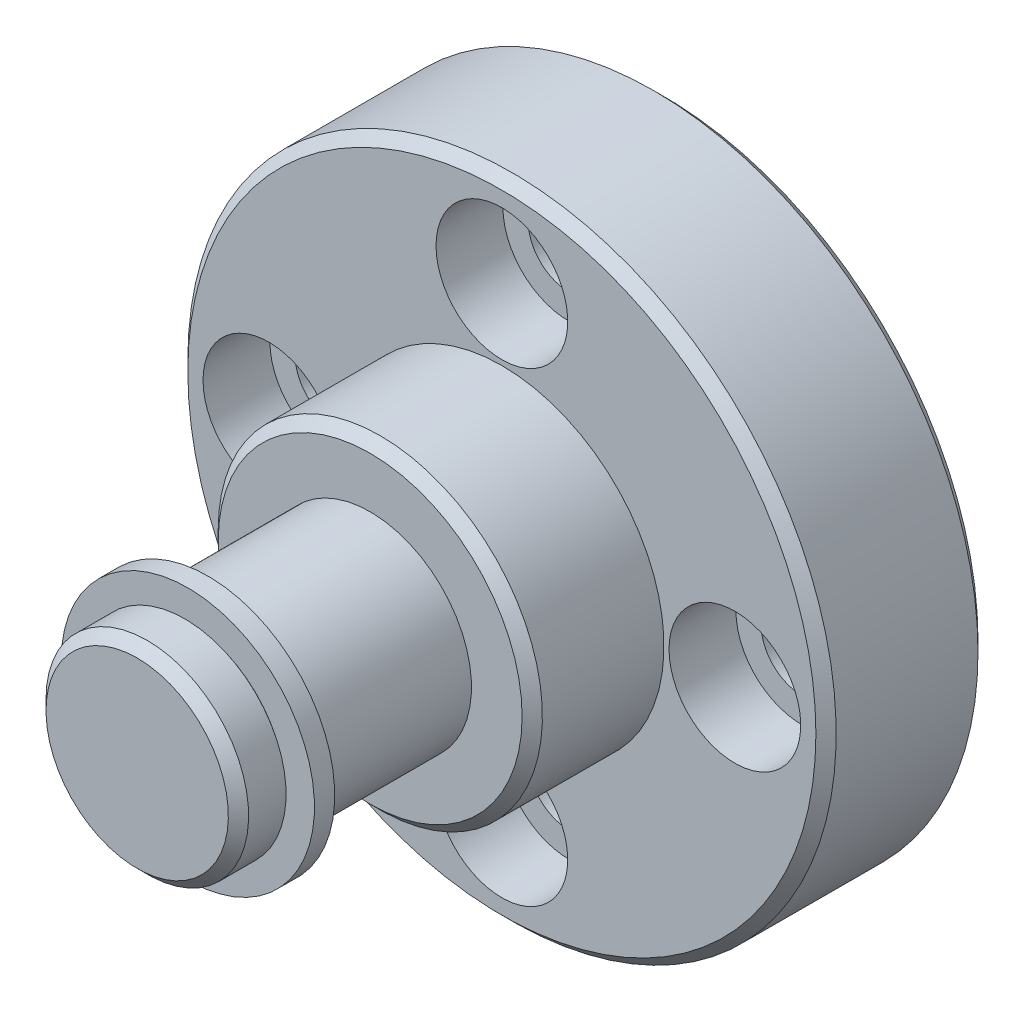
ISO-10303-21;
HEADER;
FILE_DESCRIPTION(('STEP AP214'),'2;1');
FILE_NAME('part.step','',(''),(''),'','','');
FILE_SCHEMA(('AUTOMOTIVE_DESIGN { 1 0 10303 214 1 1 1 1 }'));
ENDSEC;
DATA;
#1=APPLICATION_CONTEXT('core data for automotive mechanical design processes');
#2=APPLICATION_PROTOCOL_DEFINITION('international standard','automotive_design',2000,#1);
#3=PRODUCT_CONTEXT('',#1,'mechanical');
#4=PRODUCT('Part','Part','',(#3));
#5=PRODUCT_RELATED_PRODUCT_CATEGORY('part','',(#4));
#6=PRODUCT_DEFINITION_FORMATION('','',#4);
#7=PRODUCT_DEFINITION_CONTEXT('part definition',#1,'design');
#8=PRODUCT_DEFINITION('design','',#6,#7);
#9=PRODUCT_DEFINITION_SHAPE('','',#8);
#10=(LENGTH_UNIT() NAMED_UNIT(*) SI_UNIT(.MILLI.,.METRE.));
#11=(NAMED_UNIT(*) PLANE_ANGLE_UNIT() SI_UNIT($,.RADIAN.));
#12=(NAMED_UNIT(*) SI_UNIT($,.STERADIAN.) SOLID_ANGLE_UNIT());
#13=UNCERTAINTY_MEASURE_WITH_UNIT(LENGTH_MEASURE(1.E-05),#10,'distance_accuracy_value','');
#14=(GEOMETRIC_REPRESENTATION_CONTEXT(3) GLOBAL_UNCERTAINTY_ASSIGNED_CONTEXT((#13)) GLOBAL_UNIT_ASSIGNED_CONTEXT((#10,
#11,#12)) REPRESENTATION_CONTEXT('',''));
#15=CARTESIAN_POINT('',(0.,0.,0.));
#16=DIRECTION('',(0.,0.,1.));
#17=DIRECTION('',(1.,0.,0.));
#18=AXIS2_PLACEMENT_3D('',#15,#16,#17);
#19=CARTESIAN_POINT('',(6.946,-4.569670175,26.));
#20=DIRECTION('',(0.,0.,1.));
#21=DIRECTION('',(1.,0.,0.));
#22=AXIS2_PLACEMENT_3D('',#19,#20,#21);
#23=PLANE('',#22);
#24=CARTESIAN_POINT('',(11.5,0.,26.));
#25=DIRECTION('',(0.,0.,-1.));
#26=DIRECTION('',(0.,1.,0.));
#27=AXIS2_PLACEMENT_3D('',#24,#25,#26);
#28=CIRCLE('',#27,4.5);
#29=CARTESIAN_POINT('',(11.5,4.5,26.));
#30=VERTEX_POINT('',#29);
#31=EDGE_CURVE('E16',#30,#30,#28,.T.);
#32=ORIENTED_EDGE('',*,*,#31,.F.);
#33=EDGE_LOOP('',(#32));
#34=FACE_BOUND('',#33,.T.);
#35=ADVANCED_FACE('F12',(#34),#23,.T.);
#36=CARTESIAN_POINT('',(11.5,0.,26.));
#37=DIRECTION('',(0.,0.,-1.));
#38=DIRECTION('',(0.,1.,0.));
#39=AXIS2_PLACEMENT_3D('',#36,#37,#38);
#40=CONICAL_SURFACE('',#39,4.5,0.785398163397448);
#41=ORIENTED_EDGE('',*,*,#31,.T.);
#42=EDGE_LOOP('',(#41));
#43=FACE_BOUND('',#42,.T.);
#44=CARTESIAN_POINT('',(11.5,0.,25.5));
#45=DIRECTION('',(0.,0.,-1.));
#46=DIRECTION('',(-1.,0.,0.));
#47=AXIS2_PLACEMENT_3D('',#44,#45,#46);
#48=CIRCLE('',#47,5.);
#49=CARTESIAN_POINT('',(6.5,0.,25.5));
#50=VERTEX_POINT('',#49);
#51=EDGE_CURVE('E28',#50,#50,#48,.T.);
#52=ORIENTED_EDGE('',*,*,#51,.F.);
#53=EDGE_LOOP('',(#52));
#54=FACE_BOUND('',#53,.T.);
#55=ADVANCED_FACE('F114',(#43,#54),#40,.T.);
#56=CARTESIAN_POINT('',(11.5,0.,25.5));
#57=DIRECTION('',(0.,0.,-1.));
#58=DIRECTION('',(-1.,0.,0.));
#59=AXIS2_PLACEMENT_3D('',#56,#57,#58);
#60=CYLINDRICAL_SURFACE('',#59,5.);
#61=ORIENTED_EDGE('',*,*,#51,.T.);
#62=EDGE_LOOP('',(#61));
#63=FACE_BOUND('',#62,.T.);
#64=CARTESIAN_POINT('',(11.5,0.,23.65));
#65=DIRECTION('',(0.,0.,-1.));
#66=DIRECTION('',(-1.,0.,0.));
#67=AXIS2_PLACEMENT_3D('',#64,#65,#66);
#68=CIRCLE('',#67,5.);
#69=CARTESIAN_POINT('',(6.5,0.,23.65));
#70=VERTEX_POINT('',#69);
#71=EDGE_CURVE('E104',#70,#70,#68,.T.);
#72=ORIENTED_EDGE('',*,*,#71,.F.);
#73=EDGE_LOOP('',(#72));
#74=FACE_BOUND('',#73,.T.);
#75=ADVANCED_FACE('F124',(#63,#74),#60,.T.);
#76=CARTESIAN_POINT('',(16.56,-5.077411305,23.65));
#77=DIRECTION('',(0.,0.,-1.));
#78=DIRECTION('',(-1.,0.,0.));
#79=AXIS2_PLACEMENT_3D('',#76,#77,#78);
#80=PLANE('',#79);
#81=CARTESIAN_POINT('',(11.5,0.,23.65));
#82=DIRECTION('',(0.,0.,-1.));
#83=DIRECTION('',(-1.,0.,0.));
#84=AXIS2_PLACEMENT_3D('',#81,#82,#83);
#85=CIRCLE('',#84,4.8);
#86=CARTESIAN_POINT('',(6.7,0.,23.65));
#87=VERTEX_POINT('',#86);
#88=EDGE_CURVE('E102',#87,#87,#85,.T.);
#89=ORIENTED_EDGE('',*,*,#88,.F.);
#90=EDGE_LOOP('',(#89));
#91=FACE_BOUND('',#90,.T.);
#92=ORIENTED_EDGE('',*,*,#71,.T.);
#93=EDGE_LOOP('',(#92));
#94=FACE_BOUND('',#93,.T.);
#95=ADVANCED_FACE('F205',(#91,#94),#80,.T.);
#96=CARTESIAN_POINT('',(11.5,0.,23.65));
#97=DIRECTION('',(0.,0.,-1.));
#98=DIRECTION('',(-1.,0.,0.));
#99=AXIS2_PLACEMENT_3D('',#96,#97,#98);
#100=CYLINDRICAL_SURFACE('',#99,4.8);
#101=ORIENTED_EDGE('',*,*,#88,.T.);
#102=EDGE_LOOP('',(#101));
#103=FACE_BOUND('',#102,.T.);
#104=CARTESIAN_POINT('',(11.5,0.,23.5));
#105=DIRECTION('',(0.,0.,-1.));
#106=DIRECTION('',(-1.,0.,0.));
#107=AXIS2_PLACEMENT_3D('',#104,#105,#106);
#108=CIRCLE('',#107,4.8);
#109=CARTESIAN_POINT('',(6.7,0.,23.5));
#110=VERTEX_POINT('',#109);
#111=EDGE_CURVE('E99',#110,#110,#108,.T.);
#112=ORIENTED_EDGE('',*,*,#111,.F.);
#113=EDGE_LOOP('',(#112));
#114=FACE_BOUND('',#113,.T.);
#115=ADVANCED_FACE('F202',(#103,#114),#100,.T.);
#116=CARTESIAN_POINT('',(5.175,-6.346764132,23.5));
#117=DIRECTION('',(0.,0.,1.));
#118=DIRECTION('',(1.,0.,0.));
#119=AXIS2_PLACEMENT_3D('',#116,#117,#118);
#120=PLANE('',#119);
#121=ORIENTED_EDGE('',*,*,#111,.T.);
#122=EDGE_LOOP('',(#121));
#123=FACE_BOUND('',#122,.T.);
#124=CARTESIAN_POINT('',(11.5,0.,23.5));
#125=DIRECTION('',(0.,0.,-1.));
#126=DIRECTION('',(-1.,0.,0.));
#127=AXIS2_PLACEMENT_3D('',#124,#125,#126);
#128=CIRCLE('',#127,6.25);
#129=CARTESIAN_POINT('',(5.25,0.,23.5));
#130=VERTEX_POINT('',#129);
#131=EDGE_CURVE('E96',#130,#130,#128,.T.);
#132=ORIENTED_EDGE('',*,*,#131,.F.);
#133=EDGE_LOOP('',(#132));
#134=FACE_BOUND('',#133,.T.);
#135=ADVANCED_FACE('F200',(#123,#134),#120,.T.);
#136=CARTESIAN_POINT('',(11.5,0.,23.5));
#137=DIRECTION('',(0.,0.,-1.));
#138=DIRECTION('',(-1.,0.,0.));
#139=AXIS2_PLACEMENT_3D('',#136,#137,#138);
#140=CYLINDRICAL_SURFACE('',#139,6.25);
#141=ORIENTED_EDGE('',*,*,#131,.T.);
#142=EDGE_LOOP('',(#141));
#143=FACE_BOUND('',#142,.T.);
#144=CARTESIAN_POINT('',(11.5,0.,22.5));
#145=DIRECTION('',(0.,0.,-1.));
#146=DIRECTION('',(-1.,0.,0.));
#147=AXIS2_PLACEMENT_3D('',#144,#145,#146);
#148=CIRCLE('',#147,6.25);
#149=CARTESIAN_POINT('',(5.25,0.,22.5));
#150=VERTEX_POINT('',#149);
#151=EDGE_CURVE('E93',#150,#150,#148,.T.);
#152=ORIENTED_EDGE('',*,*,#151,.F.);
#153=EDGE_LOOP('',(#152));
#154=FACE_BOUND('',#153,.T.);
#155=ADVANCED_FACE('F197',(#143,#154),#140,.T.);
#156=CARTESIAN_POINT('',(17.825,-6.346764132,22.5));
#157=DIRECTION('',(0.,0.,-1.));
#158=DIRECTION('',(-1.,0.,0.));
#159=AXIS2_PLACEMENT_3D('',#156,#157,#158);
#160=PLANE('',#159);
#161=CARTESIAN_POINT('',(11.5,0.,22.5));
#162=DIRECTION('',(0.,0.,-1.));
#163=DIRECTION('',(-1.,0.,0.));
#164=AXIS2_PLACEMENT_3D('',#161,#162,#163);
#165=CIRCLE('',#164,5.);
#166=CARTESIAN_POINT('',(6.5,0.,22.5));
#167=VERTEX_POINT('',#166);
#168=EDGE_CURVE('E90',#167,#167,#165,.T.);
#169=ORIENTED_EDGE('',*,*,#168,.F.);
#170=EDGE_LOOP('',(#169));
#171=FACE_BOUND('',#170,.T.);
#172=ORIENTED_EDGE('',*,*,#151,.T.);
#173=EDGE_LOOP('',(#172));
#174=FACE_BOUND('',#173,.T.);
#175=ADVANCED_FACE('F195',(#171,#174),#160,.T.);
#176=CARTESIAN_POINT('',(11.5,0.,22.5));
#177=DIRECTION('',(0.,0.,-1.));
#178=DIRECTION('',(-1.,0.,0.));
#179=AXIS2_PLACEMENT_3D('',#176,#177,#178);
#180=CYLINDRICAL_SURFACE('',#179,5.);
#181=ORIENTED_EDGE('',*,*,#168,.T.);
#182=EDGE_LOOP('',(#181));
#183=FACE_BOUND('',#182,.T.);
#184=CARTESIAN_POINT('',(11.5,0.,14.5));
#185=DIRECTION('',(0.,0.,-1.));
#186=DIRECTION('',(-1.,0.,0.));
#187=AXIS2_PLACEMENT_3D('',#184,#185,#186);
#188=CIRCLE('',#187,5.);
#189=CARTESIAN_POINT('',(6.5,0.,14.5));
#190=VERTEX_POINT('',#189);
#191=EDGE_CURVE('E87',#190,#190,#188,.T.);
#192=ORIENTED_EDGE('',*,*,#191,.F.);
#193=EDGE_LOOP('',(#192));
#194=FACE_BOUND('',#193,.T.);
#195=ADVANCED_FACE('F191',(#183,#194),#180,.T.);
#196=CARTESIAN_POINT('',(11.5,0.,0.));
#197=DIRECTION('',(0.,0.,1.));
#198=DIRECTION('',(1.,0.,0.));
#199=AXIS2_PLACEMENT_3D('',#196,#197,#198);
#200=CONICAL_SURFACE('',#199,15.5,0.785398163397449);
#201=CARTESIAN_POINT('',(11.5,0.,0.));
#202=DIRECTION('',(0.,0.,1.));
#203=DIRECTION('',(1.,0.,0.));
#204=AXIS2_PLACEMENT_3D('',#201,#202,#203);
#205=CIRCLE('',#204,15.5);
#206=CARTESIAN_POINT('',(27.,0.,0.));
#207=VERTEX_POINT('',#206);
#208=EDGE_CURVE('E84',#207,#207,#205,.F.);
#209=ORIENTED_EDGE('',*,*,#208,.F.);
#210=EDGE_LOOP('',(#209));
#211=FACE_BOUND('',#210,.T.);
#212=CARTESIAN_POINT('',(11.5,0.,0.5));
#213=DIRECTION('',(0.,0.,-1.));
#214=DIRECTION('',(-1.,0.,0.));
#215=AXIS2_PLACEMENT_3D('',#212,#213,#214);
#216=CIRCLE('',#215,16.);
#217=CARTESIAN_POINT('',(-4.5,0.,0.5));
#218=VERTEX_POINT('',#217);
#219=EDGE_CURVE('E74',#218,#218,#216,.F.);
#220=ORIENTED_EDGE('',*,*,#219,.F.);
#221=EDGE_LOOP('',(#220));
#222=FACE_BOUND('',#221,.T.);
#223=ADVANCED_FACE('F187',(#211,#222),#200,.T.);
#224=CARTESIAN_POINT('',(11.5,-11.5,4.7));
#225=DIRECTION('',(0.,0.,-1.));
#226=DIRECTION('',(-1.,0.,0.));
#227=AXIS2_PLACEMENT_3D('',#224,#225,#226);
#228=CYLINDRICAL_SURFACE('',#227,2.);
#229=CARTESIAN_POINT('',(11.5,-11.5,4.7));
#230=DIRECTION('',(0.,0.,-1.));
#231=DIRECTION('',(-1.,0.,0.));
#232=AXIS2_PLACEMENT_3D('',#229,#230,#231);
#233=CIRCLE('',#232,2.);
#234=CARTESIAN_POINT('',(9.5,-11.5,4.7));
#235=VERTEX_POINT('',#234);
#236=EDGE_CURVE('E71',#235,#235,#233,.F.);
#237=ORIENTED_EDGE('',*,*,#236,.T.);
#238=EDGE_LOOP('',(#237));
#239=FACE_BOUND('',#238,.T.);
#240=CARTESIAN_POINT('',(11.5,-11.5,0.));
#241=DIRECTION('',(0.,0.,-1.));
#242=DIRECTION('',(-1.,0.,0.));
#243=AXIS2_PLACEMENT_3D('',#240,#241,#242);
#244=CIRCLE('',#243,2.);
#245=CARTESIAN_POINT('',(9.5,-11.5,0.));
#246=VERTEX_POINT('',#245);
#247=EDGE_CURVE('E81',#246,#246,#244,.F.);
#248=ORIENTED_EDGE('',*,*,#247,.F.);
#249=EDGE_LOOP('',(#248));
#250=FACE_BOUND('',#249,.T.);
#251=ADVANCED_FACE('F183',(#239,#250),#228,.F.);
#252=CARTESIAN_POINT('',(23.,0.,4.7));
#253=DIRECTION('',(0.,0.,-1.));
#254=DIRECTION('',(-1.,0.,0.));
#255=AXIS2_PLACEMENT_3D('',#252,#253,#254);
#256=CYLINDRICAL_SURFACE('',#255,2.);
#257=CARTESIAN_POINT('',(23.,0.,4.7));
#258=DIRECTION('',(0.,0.,-1.));
#259=DIRECTION('',(-1.,0.,0.));
#260=AXIS2_PLACEMENT_3D('',#257,#258,#259);
#261=CIRCLE('',#260,2.);
#262=CARTESIAN_POINT('',(21.,0.,4.7));
#263=VERTEX_POINT('',#262);
#264=EDGE_CURVE('E68',#263,#263,#261,.F.);
#265=ORIENTED_EDGE('',*,*,#264,.T.);
#266=EDGE_LOOP('',(#265));
#267=FACE_BOUND('',#266,.T.);
#268=CARTESIAN_POINT('',(23.,0.,0.));
#269=DIRECTION('',(0.,0.,-1.));
#270=DIRECTION('',(-1.,0.,0.));
#271=AXIS2_PLACEMENT_3D('',#268,#269,#270);
#272=CIRCLE('',#271,2.);
#273=CARTESIAN_POINT('',(21.,0.,0.));
#274=VERTEX_POINT('',#273);
#275=EDGE_CURVE('E78',#274,#274,#272,.F.);
#276=ORIENTED_EDGE('',*,*,#275,.F.);
#277=EDGE_LOOP('',(#276));
#278=FACE_BOUND('',#277,.T.);
#279=ADVANCED_FACE('F179',(#267,#278),#256,.F.);
#280=CARTESIAN_POINT('',(11.5,11.5,4.7));
#281=DIRECTION('',(0.,0.,-1.));
#282=DIRECTION('',(-1.,0.,0.));
#283=AXIS2_PLACEMENT_3D('',#280,#281,#282);
#284=CYLINDRICAL_SURFACE('',#283,2.);
#285=CARTESIAN_POINT('',(11.5,11.5,4.7));
#286=DIRECTION('',(0.,0.,-1.));
#287=DIRECTION('',(-1.,0.,0.));
#288=AXIS2_PLACEMENT_3D('',#285,#286,#287);
#289=CIRCLE('',#288,2.);
#290=CARTESIAN_POINT('',(9.5,11.5,4.7));
#291=VERTEX_POINT('',#290);
#292=EDGE_CURVE('E65',#291,#291,#289,.F.);
#293=ORIENTED_EDGE('',*,*,#292,.T.);
#294=EDGE_LOOP('',(#293));
#295=FACE_BOUND('',#294,.T.);
#296=CARTESIAN_POINT('',(11.5,11.5,0.));
#297=DIRECTION('',(0.,0.,-1.));
#298=DIRECTION('',(-1.,0.,0.));
#299=AXIS2_PLACEMENT_3D('',#296,#297,#298);
#300=CIRCLE('',#299,2.);
#301=CARTESIAN_POINT('',(9.5,11.5,0.));
#302=VERTEX_POINT('',#301);
#303=EDGE_CURVE('E75',#302,#302,#300,.F.);
#304=ORIENTED_EDGE('',*,*,#303,.F.);
#305=EDGE_LOOP('',(#304));
#306=FACE_BOUND('',#305,.T.);
#307=ADVANCED_FACE('F175',(#295,#306),#284,.F.);
#308=CARTESIAN_POINT('',(3.91,-7.616116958,14.5));
#309=DIRECTION('',(0.,0.,1.));
#310=DIRECTION('',(1.,0.,0.));
#311=AXIS2_PLACEMENT_3D('',#308,#309,#310);
#312=PLANE('',#311);
#313=ORIENTED_EDGE('',*,*,#191,.T.);
#314=EDGE_LOOP('',(#313));
#315=FACE_BOUND('',#314,.T.);
#316=CARTESIAN_POINT('',(11.5,0.,14.5));
#317=DIRECTION('',(0.,0.,-1.));
#318=DIRECTION('',(-1.,0.,0.));
#319=AXIS2_PLACEMENT_3D('',#316,#317,#318);
#320=CIRCLE('',#319,7.5);
#321=CARTESIAN_POINT('',(4.,0.,14.5));
#322=VERTEX_POINT('',#321);
#323=EDGE_CURVE('E62',#322,#322,#320,.T.);
#324=ORIENTED_EDGE('',*,*,#323,.F.);
#325=EDGE_LOOP('',(#324));
#326=FACE_BOUND('',#325,.T.);
#327=ADVANCED_FACE('F178',(#315,#326),#312,.T.);
#328=CARTESIAN_POINT('',(27.186,-15.739975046,0.));
#329=DIRECTION('',(0.,0.,-1.));
#330=DIRECTION('',(-1.,0.,0.));
#331=AXIS2_PLACEMENT_3D('',#328,#329,#330);
#332=PLANE('',#331);
#333=ORIENTED_EDGE('',*,*,#303,.T.);
#334=EDGE_LOOP('',(#333));
#335=FACE_BOUND('',#334,.T.);
#336=ORIENTED_EDGE('',*,*,#275,.T.);
#337=EDGE_LOOP('',(#336));
#338=FACE_BOUND('',#337,.T.);
#339=ORIENTED_EDGE('',*,*,#247,.T.);
#340=EDGE_LOOP('',(#339));
#341=FACE_BOUND('',#340,.T.);
#342=CARTESIAN_POINT('',(0.,0.,0.));
#343=DIRECTION('',(0.,0.,-1.));
#344=DIRECTION('',(-1.,0.,0.));
#345=AXIS2_PLACEMENT_3D('',#342,#343,#344);
#346=CIRCLE('',#345,2.);
#347=CARTESIAN_POINT('',(-2.,0.,0.));
#348=VERTEX_POINT('',#347);
#349=EDGE_CURVE('E59',#348,#348,#346,.F.);
#350=ORIENTED_EDGE('',*,*,#349,.T.);
#351=EDGE_LOOP('',(#350));
#352=FACE_BOUND('',#351,.T.);
#353=ORIENTED_EDGE('',*,*,#208,.T.);
#354=EDGE_LOOP('',(#353));
#355=FACE_BOUND('',#354,.T.);
#356=ADVANCED_FACE('F173',(#335,#338,#341,#352,#355),#332,.T.);
#357=CARTESIAN_POINT('',(11.5,0.,7.5));
#358=DIRECTION('',(0.,0.,-1.));
#359=DIRECTION('',(0.,1.,0.));
#360=AXIS2_PLACEMENT_3D('',#357,#358,#359);
#361=CYLINDRICAL_SURFACE('',#360,16.);
#362=CARTESIAN_POINT('',(11.5,0.,7.5));
#363=DIRECTION('',(0.,0.,-1.));
#364=DIRECTION('',(-1.,0.,0.));
#365=AXIS2_PLACEMENT_3D('',#362,#363,#364);
#366=CIRCLE('',#365,16.);
#367=CARTESIAN_POINT('',(-4.5,0.,7.49999999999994));
#368=VERTEX_POINT('',#367);
#369=EDGE_CURVE('E58',#368,#368,#366,.F.);
#370=ORIENTED_EDGE('',*,*,#369,.F.);
#371=EDGE_LOOP('',(#370));
#372=FACE_BOUND('',#371,.T.);
#373=ORIENTED_EDGE('',*,*,#219,.T.);
#374=EDGE_LOOP('',(#373));
#375=FACE_BOUND('',#374,.T.);
#376=ADVANCED_FACE('F169',(#372,#375),#361,.T.);
#377=CARTESIAN_POINT('',(8.211,-8.199682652,4.7));
#378=DIRECTION('',(0.,0.,-1.));
#379=DIRECTION('',(1.,0.,0.));
#380=AXIS2_PLACEMENT_3D('',#377,#378,#379);
#381=PLANE('',#380);
#382=ORIENTED_EDGE('',*,*,#236,.F.);
#383=EDGE_LOOP('',(#382));
#384=FACE_BOUND('',#383,.T.);
#385=CARTESIAN_POINT('',(11.5,-11.5,4.7));
#386=DIRECTION('',(0.,0.,-1.));
#387=DIRECTION('',(-1.,0.,0.));
#388=AXIS2_PLACEMENT_3D('',#385,#386,#387);
#389=CIRCLE('',#388,3.25);
#390=CARTESIAN_POINT('',(8.25,-11.5,4.7));
#391=VERTEX_POINT('',#390);
#392=EDGE_CURVE('E55',#391,#391,#389,.F.);
#393=ORIENTED_EDGE('',*,*,#392,.T.);
#394=EDGE_LOOP('',(#393));
#395=FACE_BOUND('',#394,.T.);
#396=ADVANCED_FACE('F172',(#384,#395),#381,.F.);
#397=CARTESIAN_POINT('',(19.699682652,-3.289,4.7));
#398=DIRECTION('',(0.,0.,-1.));
#399=DIRECTION('',(0.,1.,0.));
#400=AXIS2_PLACEMENT_3D('',#397,#398,#399);
#401=PLANE('',#400);
#402=ORIENTED_EDGE('',*,*,#264,.F.);
#403=EDGE_LOOP('',(#402));
#404=FACE_BOUND('',#403,.T.);
#405=CARTESIAN_POINT('',(23.,0.,4.7));
#406=DIRECTION('',(0.,0.,-1.));
#407=DIRECTION('',(-1.,0.,0.));
#408=AXIS2_PLACEMENT_3D('',#405,#406,#407);
#409=CIRCLE('',#408,3.25);
#410=CARTESIAN_POINT('',(19.75,0.,4.7));
#411=VERTEX_POINT('',#410);
#412=EDGE_CURVE('E52',#411,#411,#409,.F.);
#413=ORIENTED_EDGE('',*,*,#412,.T.);
#414=EDGE_LOOP('',(#413));
#415=FACE_BOUND('',#414,.T.);
#416=ADVANCED_FACE('F233',(#404,#415),#401,.F.);
#417=CARTESIAN_POINT('',(14.789,8.199682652,4.7));
#418=DIRECTION('',(0.,0.,-1.));
#419=DIRECTION('',(-1.,0.,0.));
#420=AXIS2_PLACEMENT_3D('',#417,#418,#419);
#421=PLANE('',#420);
#422=ORIENTED_EDGE('',*,*,#292,.F.);
#423=EDGE_LOOP('',(#422));
#424=FACE_BOUND('',#423,.T.);
#425=CARTESIAN_POINT('',(11.5,11.5,4.7));
#426=DIRECTION('',(0.,0.,-1.));
#427=DIRECTION('',(-1.,0.,0.));
#428=AXIS2_PLACEMENT_3D('',#425,#426,#427);
#429=CIRCLE('',#428,3.25);
#430=CARTESIAN_POINT('',(8.25,11.5,4.7));
#431=VERTEX_POINT('',#430);
#432=EDGE_CURVE('E49',#431,#431,#429,.F.);
#433=ORIENTED_EDGE('',*,*,#432,.T.);
#434=EDGE_LOOP('',(#433));
#435=FACE_BOUND('',#434,.T.);
#436=ADVANCED_FACE('F167',(#424,#435),#421,.F.);
#437=CARTESIAN_POINT('',(11.5,0.,14.5));
#438=DIRECTION('',(0.,0.,-1.));
#439=DIRECTION('',(-1.,0.,0.));
#440=AXIS2_PLACEMENT_3D('',#437,#438,#439);
#441=CONICAL_SURFACE('',#440,7.5,0.785398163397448);
#442=ORIENTED_EDGE('',*,*,#323,.T.);
#443=EDGE_LOOP('',(#442));
#444=FACE_BOUND('',#443,.T.);
#445=CARTESIAN_POINT('',(11.5,0.,14.));
#446=DIRECTION('',(0.,0.,-1.));
#447=DIRECTION('',(-1.,0.,0.));
#448=AXIS2_PLACEMENT_3D('',#445,#446,#447);
#449=CIRCLE('',#448,8.);
#450=CARTESIAN_POINT('',(3.5,0.,14.));
#451=VERTEX_POINT('',#450);
#452=EDGE_CURVE('E48',#451,#451,#449,.T.);
#453=ORIENTED_EDGE('',*,*,#452,.F.);
#454=EDGE_LOOP('',(#453));
#455=FACE_BOUND('',#454,.T.);
#456=ADVANCED_FACE('F163',(#444,#455),#441,.T.);
#457=CARTESIAN_POINT('',(0.,0.,4.7));
#458=DIRECTION('',(0.,0.,-1.));
#459=DIRECTION('',(-1.,0.,0.));
#460=AXIS2_PLACEMENT_3D('',#457,#458,#459);
#461=CYLINDRICAL_SURFACE('',#460,2.);
#462=CARTESIAN_POINT('',(0.,0.,4.7));
#463=DIRECTION('',(0.,0.,-1.));
#464=DIRECTION('',(-1.,0.,0.));
#465=AXIS2_PLACEMENT_3D('',#462,#463,#464);
#466=CIRCLE('',#465,2.);
#467=CARTESIAN_POINT('',(-2.,0.,4.7));
#468=VERTEX_POINT('',#467);
#469=EDGE_CURVE('E45',#468,#468,#466,.F.);
#470=ORIENTED_EDGE('',*,*,#469,.T.);
#471=EDGE_LOOP('',(#470));
#472=FACE_BOUND('',#471,.T.);
#473=ORIENTED_EDGE('',*,*,#349,.F.);
#474=EDGE_LOOP('',(#473));
#475=FACE_BOUND('',#474,.T.);
#476=ADVANCED_FACE('F159',(#472,#475),#461,.F.);
#477=CARTESIAN_POINT('',(11.5,0.,8.));
#478=DIRECTION('',(0.,0.,-1.));
#479=DIRECTION('',(-1.,0.,0.));
#480=AXIS2_PLACEMENT_3D('',#477,#478,#479);
#481=CONICAL_SURFACE('',#480,15.5,0.785398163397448);
#482=CARTESIAN_POINT('',(11.5,0.,8.));
#483=DIRECTION('',(0.,0.,-1.));
#484=DIRECTION('',(-1.,0.,0.));
#485=AXIS2_PLACEMENT_3D('',#482,#483,#484);
#486=CIRCLE('',#485,15.5);
#487=CARTESIAN_POINT('',(-4.,0.,8.));
#488=VERTEX_POINT('',#487);
#489=EDGE_CURVE('E42',#488,#488,#486,.F.);
#490=ORIENTED_EDGE('',*,*,#489,.F.);
#491=EDGE_LOOP('',(#490));
#492=FACE_BOUND('',#491,.T.);
#493=ORIENTED_EDGE('',*,*,#369,.T.);
#494=EDGE_LOOP('',(#493));
#495=FACE_BOUND('',#494,.T.);
#496=ADVANCED_FACE('F155',(#492,#495),#481,.T.);
#497=CARTESIAN_POINT('',(11.5,-11.5,8.));
#498=DIRECTION('',(0.,0.,-1.));
#499=DIRECTION('',(-1.,0.,0.));
#500=AXIS2_PLACEMENT_3D('',#497,#498,#499);
#501=CYLINDRICAL_SURFACE('',#500,3.25);
#502=ORIENTED_EDGE('',*,*,#392,.F.);
#503=EDGE_LOOP('',(#502));
#504=FACE_BOUND('',#503,.T.);
#505=CARTESIAN_POINT('',(11.5,-11.5,8.));
#506=DIRECTION('',(0.,0.,-1.));
#507=DIRECTION('',(-1.,0.,0.));
#508=AXIS2_PLACEMENT_3D('',#505,#506,#507);
#509=CIRCLE('',#508,3.25);
#510=CARTESIAN_POINT('',(8.25,-11.5,8.));
#511=VERTEX_POINT('',#510);
#512=EDGE_CURVE('E39',#511,#511,#509,.T.);
#513=ORIENTED_EDGE('',*,*,#512,.F.);
#514=EDGE_LOOP('',(#513));
#515=FACE_BOUND('',#514,.T.);
#516=ADVANCED_FACE('F151',(#504,#515),#501,.F.);
#517=CARTESIAN_POINT('',(23.,0.,8.));
#518=DIRECTION('',(0.,0.,-1.));
#519=DIRECTION('',(-1.,0.,0.));
#520=AXIS2_PLACEMENT_3D('',#517,#518,#519);
#521=CYLINDRICAL_SURFACE('',#520,3.25);
#522=ORIENTED_EDGE('',*,*,#412,.F.);
#523=EDGE_LOOP('',(#522));
#524=FACE_BOUND('',#523,.T.);
#525=CARTESIAN_POINT('',(23.,0.,8.));
#526=DIRECTION('',(0.,0.,-1.));
#527=DIRECTION('',(-1.,0.,0.));
#528=AXIS2_PLACEMENT_3D('',#525,#526,#527);
#529=CIRCLE('',#528,3.25);
#530=CARTESIAN_POINT('',(19.75,0.,8.));
#531=VERTEX_POINT('',#530);
#532=EDGE_CURVE('E36',#531,#531,#529,.T.);
#533=ORIENTED_EDGE('',*,*,#532,.F.);
#534=EDGE_LOOP('',(#533));
#535=FACE_BOUND('',#534,.T.);
#536=ADVANCED_FACE('F147',(#524,#535),#521,.F.);
#537=CARTESIAN_POINT('',(11.5,11.5,8.));
#538=DIRECTION('',(0.,0.,-1.));
#539=DIRECTION('',(-1.,0.,0.));
#540=AXIS2_PLACEMENT_3D('',#537,#538,#539);
#541=CYLINDRICAL_SURFACE('',#540,3.25);
#542=ORIENTED_EDGE('',*,*,#432,.F.);
#543=EDGE_LOOP('',(#542));
#544=FACE_BOUND('',#543,.T.);
#545=CARTESIAN_POINT('',(11.5,11.5,8.));
#546=DIRECTION('',(0.,0.,-1.));
#547=DIRECTION('',(-1.,0.,0.));
#548=AXIS2_PLACEMENT_3D('',#545,#546,#547);
#549=CIRCLE('',#548,3.25);
#550=CARTESIAN_POINT('',(8.25,11.5,8.));
#551=VERTEX_POINT('',#550);
#552=EDGE_CURVE('E33',#551,#551,#549,.T.);
#553=ORIENTED_EDGE('',*,*,#552,.F.);
#554=EDGE_LOOP('',(#553));
#555=FACE_BOUND('',#554,.T.);
#556=ADVANCED_FACE('F143',(#544,#555),#541,.F.);
#557=CARTESIAN_POINT('',(11.5,0.,14.));
#558=DIRECTION('',(0.,0.,-1.));
#559=DIRECTION('',(0.,1.,0.));
#560=AXIS2_PLACEMENT_3D('',#557,#558,#559);
#561=CYLINDRICAL_SURFACE('',#560,8.);
#562=ORIENTED_EDGE('',*,*,#452,.T.);
#563=EDGE_LOOP('',(#562));
#564=FACE_BOUND('',#563,.T.);
#565=CARTESIAN_POINT('',(11.5,0.,8.));
#566=DIRECTION('',(0.,0.,-1.));
#567=DIRECTION('',(0.,1.,0.));
#568=AXIS2_PLACEMENT_3D('',#565,#566,#567);
#569=CIRCLE('',#568,8.);
#570=CARTESIAN_POINT('',(11.5,8.,8.));
#571=VERTEX_POINT('',#570);
#572=EDGE_CURVE('E25',#571,#571,#569,.T.);
#573=ORIENTED_EDGE('',*,*,#572,.F.);
#574=EDGE_LOOP('',(#573));
#575=FACE_BOUND('',#574,.T.);
#576=ADVANCED_FACE('F140',(#564,#575),#561,.T.);
#577=CARTESIAN_POINT('',(3.300317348,3.289,4.7));
#578=DIRECTION('',(0.,0.,-1.));
#579=DIRECTION('',(0.,-1.,0.));
#580=AXIS2_PLACEMENT_3D('',#577,#578,#579);
#581=PLANE('',#580);
#582=ORIENTED_EDGE('',*,*,#469,.F.);
#583=EDGE_LOOP('',(#582));
#584=FACE_BOUND('',#583,.T.);
#585=CARTESIAN_POINT('',(0.,0.,4.7));
#586=DIRECTION('',(0.,0.,-1.));
#587=DIRECTION('',(-1.,0.,0.));
#588=AXIS2_PLACEMENT_3D('',#585,#586,#587);
#589=CIRCLE('',#588,3.25);
#590=CARTESIAN_POINT('',(-3.25,0.,4.7));
#591=VERTEX_POINT('',#590);
#592=EDGE_CURVE('E20',#591,#591,#589,.F.);
#593=ORIENTED_EDGE('',*,*,#592,.T.);
#594=EDGE_LOOP('',(#593));
#595=FACE_BOUND('',#594,.T.);
#596=ADVANCED_FACE('F135',(#584,#595),#581,.F.);
#597=CARTESIAN_POINT('',(-4.186,-15.739975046,8.));
#598=DIRECTION('',(0.,0.,1.));
#599=DIRECTION('',(1.,0.,0.));
#600=AXIS2_PLACEMENT_3D('',#597,#598,#599);
#601=PLANE('',#600);
#602=ORIENTED_EDGE('',*,*,#572,.T.);
#603=EDGE_LOOP('',(#602));
#604=FACE_BOUND('',#603,.T.);
#605=ORIENTED_EDGE('',*,*,#552,.T.);
#606=EDGE_LOOP('',(#605));
#607=FACE_BOUND('',#606,.T.);
#608=ORIENTED_EDGE('',*,*,#532,.T.);
#609=EDGE_LOOP('',(#608));
#610=FACE_BOUND('',#609,.T.);
#611=ORIENTED_EDGE('',*,*,#512,.T.);
#612=EDGE_LOOP('',(#611));
#613=FACE_BOUND('',#612,.T.);
#614=CARTESIAN_POINT('',(0.,0.,8.));
#615=DIRECTION('',(0.,0.,-1.));
#616=DIRECTION('',(-1.,0.,0.));
#617=AXIS2_PLACEMENT_3D('',#614,#615,#616);
#618=CIRCLE('',#617,3.25);
#619=CARTESIAN_POINT('',(-3.25,0.,8.));
#620=VERTEX_POINT('',#619);
#621=EDGE_CURVE('E8',#620,#620,#618,.T.);
#622=ORIENTED_EDGE('',*,*,#621,.T.);
#623=EDGE_LOOP('',(#622));
#624=FACE_BOUND('',#623,.T.);
#625=ORIENTED_EDGE('',*,*,#489,.T.);
#626=EDGE_LOOP('',(#625));
#627=FACE_BOUND('',#626,.T.);
#628=ADVANCED_FACE('F14',(#604,#607,#610,#613,#624,#627),#601,.T.);
#629=CARTESIAN_POINT('',(0.,0.,8.));
#630=DIRECTION('',(0.,0.,-1.));
#631=DIRECTION('',(-1.,0.,0.));
#632=AXIS2_PLACEMENT_3D('',#629,#630,#631);
#633=CYLINDRICAL_SURFACE('',#632,3.25);
#634=ORIENTED_EDGE('',*,*,#592,.F.);
#635=EDGE_LOOP('',(#634));
#636=FACE_BOUND('',#635,.T.);
#637=ORIENTED_EDGE('',*,*,#621,.F.);
#638=EDGE_LOOP('',(#637));
#639=FACE_BOUND('',#638,.T.);
#640=ADVANCED_FACE('F128',(#636,#639),#633,.F.);
#641=CLOSED_SHELL('',(#35,#55,#75,#95,#115,#135,#155,#175,#195,#223,#251,#279,#307,#327,#356,
#376,#396,#416,#436,#456,#476,#496,#516,#536,#556,#576,#596,#628,#640));
#642=MANIFOLD_SOLID_BREP('B1',#641);
#643=ADVANCED_BREP_SHAPE_REPRESENTATION('',(#18,#642),#14);
#644=SHAPE_DEFINITION_REPRESENTATION(#9,#643);
ENDSEC;
END-ISO-10303-21;
